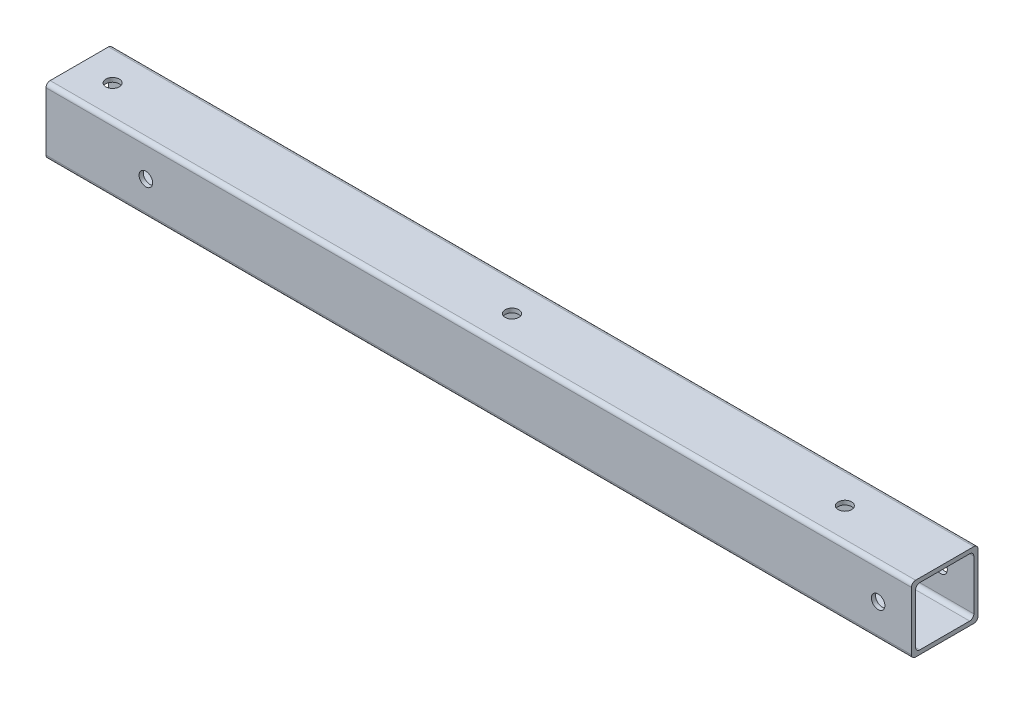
from build123d import *

# Parameters (mm, degrees)
SKETCH1_W          = 1320.8
SKETCH1_H          = 101.6
EXTRUDE1_DEPTH     = 101.6
CUT_EXTRUDE1_REACH = 1330.592
SKETCH2_W          = 88.9
SKETCH2_H          = 88.9
FILLET1_R          = 6.35
SKETCH3_R          = 10.31875
CUT_EXTRUDE2_DEPTH = 101.6
SKETCH4_R          = 10.31875
CUT_EXTRUDE3_DEPTH = 101.6
SKETCH5_R          = 10.31875
CUT_EXTRUDE4_DEPTH = 101.6
SKETCH6_R          = 10.31875
CUT_EXTRUDE5_DEPTH = 101.6
SKETCH8_R          = 10.31875
CUT_EXTRUDE7_DEPTH = 1329.592397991


with BuildPart() as part:
    # Sketch1 → Extrude1 (new body)
    with BuildSketch(Plane(origin=(0, 0, 0), x_dir=(1, 0, 0), z_dir=(0, 1, 0))):
        with Locations((-660.4, -50.8)):
            Rectangle(SKETCH1_W, SKETCH1_H)
    extrude(amount=EXTRUDE1_DEPTH)

    # Sketch2 → Cut-Extrude1 (cut, up to next)
    with BuildSketch(Plane.ZY.offset(1320.8), mode=Mode.PRIVATE) as cut_extrude1_sk1:
        with Locations((50.8, 50.8)):
            Rectangle(SKETCH2_W, SKETCH2_H)
    cut_extrude1_tool1 = extrude(cut_extrude1_sk1.sketch, amount=-CUT_EXTRUDE1_REACH, mode=Mode.PRIVATE) & part.part
    add(cut_extrude1_tool1.solids().sort_by_distance((-1320.8, 50.8, 50.8))[0], mode=Mode.SUBTRACT)

    # Fillet1
    fillet1_edges = [part.edges().sort_by_distance(p)[0] for p in [
        (-660.4, 101.6, 101.6),
        (-660.4, 6.35, 6.35),
        (-660.4, 95.25, 6.35),
        (-660.4, 95.25, 95.25),
        (-660.4, 6.35, 95.25),
        (-660.4, 0, 101.6),
        (-660.4, 0, 0),
        (-660.4, 101.6, 0),
    ]]
    fillet(fillet1_edges, radius=FILLET1_R)

    # Sketch3 → Cut-Extrude2 (cut)
    with BuildSketch(Plane(origin=(0, 101.6, 0), x_dir=(1, 0, 0), z_dir=(0, 1, 0))):
        with Locations(Location((-1270, -50.8, 0), (0, 0, 270))):
            Circle(SKETCH3_R)
    extrude(amount=-CUT_EXTRUDE2_DEPTH, mode=Mode.SUBTRACT)

    # Sketch4 → Cut-Extrude3 (cut)
    with BuildSketch(Plane.XY.offset(101.6)):
        with Locations((-1168.4, 50.8)):
            Circle(SKETCH4_R)
    extrude(amount=-CUT_EXTRUDE3_DEPTH, mode=Mode.SUBTRACT)

    # Sketch5 → Cut-Extrude4 (cut)
    with BuildSketch(Plane.XY.offset(101.6)):
        with Locations((-50.8, 50.8)):
            Circle(SKETCH5_R)
    extrude(amount=-CUT_EXTRUDE4_DEPTH, mode=Mode.SUBTRACT)

    # Sketch6 → Cut-Extrude5 (cut)
    with BuildSketch(Plane(origin=(0, 101.6, 0), x_dir=(1, 0, 0), z_dir=(0, 1, 0))):
        with Locations(Location((-152.4, -50.8, 0), (0, 0, 270))):
            Circle(SKETCH6_R)
    extrude(amount=-CUT_EXTRUDE5_DEPTH, mode=Mode.SUBTRACT)

    # Sketch8 → Cut-Extrude7 (cut, through all)
    with BuildSketch(Plane.XZ):
        with Locations(Location((-660.4, 50.8, 0), (0, 0, 270))):
            Circle(SKETCH8_R)
    extrude(amount=-CUT_EXTRUDE7_DEPTH, mode=Mode.SUBTRACT)


solid = part.part
